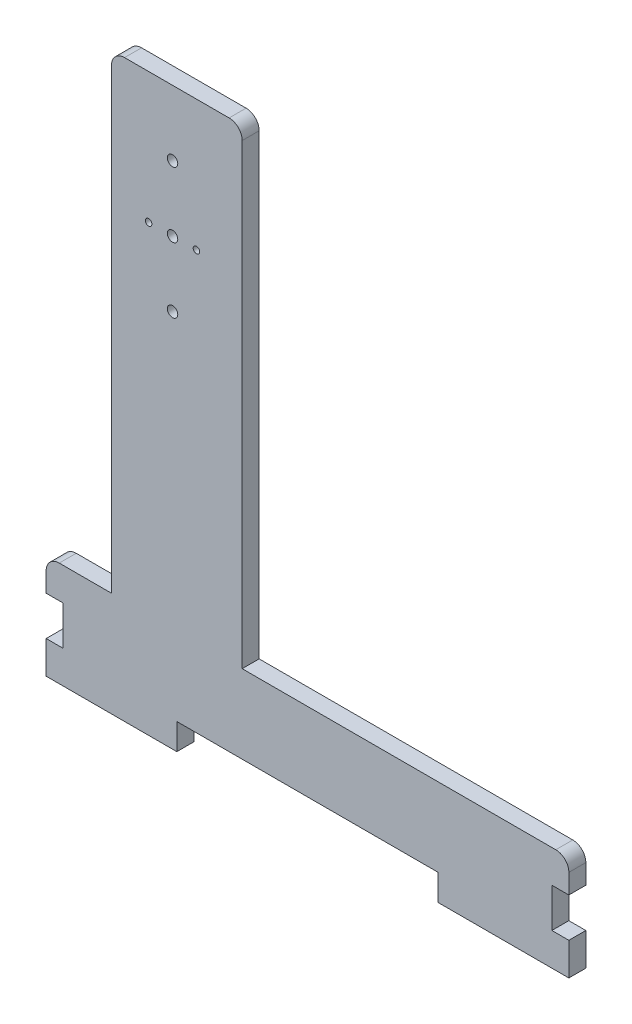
from build123d import *

# Parameters (mm, degrees)
SALIENTE_EXTRUIR1_DEPTH = 13
REDONDEO3_R             = 10
REDONDEO4_R             = 10
REDONDEO5_R             = 10
REDONDEO6_R             = 10
CROQUIS2_R              = 4
CROQUIS2_R_2            = 2.5
CROQUIS2_W              = 13
CROQUIS2_H              = 30
CORTAR_EXTRUIR1_DEPTH   = 13


with BuildPart() as part:
    # Croquis1 → Saliente-Extruir1 (new body)
    with BuildSketch(Plane.XY):
        Polygon((100, -40), (200, -40), (200, 40), (-50, 40), (-50, 400), (-150, 400), (-150, 40), (-200, 40), (-200, -40), (-100, -40), (-100, -20), (100, -20), align=None)
    extrude(amount=SALIENTE_EXTRUIR1_DEPTH)

    # Redondeo3
    redondeo3_edges = [part.edges().sort_by_distance(p)[0] for p in [
        (-150, 400, 6.5),
    ]]
    fillet(redondeo3_edges, radius=REDONDEO3_R)

    # Redondeo4
    redondeo4_edges = [part.edges().sort_by_distance(p)[0] for p in [
        (-50, 400, 6.5),
    ]]
    fillet(redondeo4_edges, radius=REDONDEO4_R)

    # Redondeo5
    redondeo5_edges = [part.edges().sort_by_distance(p)[0] for p in [
        (200, 40, 6.5),
    ]]
    fillet(redondeo5_edges, radius=REDONDEO5_R)

    # Redondeo6
    redondeo6_edges = [part.edges().sort_by_distance(p)[0] for p in [
        (-200, 40, 6.5),
    ]]
    fillet(redondeo6_edges, radius=REDONDEO6_R)

    # Croquis2 → Cortar-Extruir1 (cut)
    with BuildSketch(Plane.XY.offset(13)):
        with Locations((0, 350)):
            Circle(CROQUIS2_R)
        with Locations((0, 250)):
            Circle(CROQUIS2_R)
        with Locations((18.25, 300)):
            Circle(CROQUIS2_R_2)
        with Locations((-18.25, 300)):
            Circle(CROQUIS2_R_2)
        with Locations((0, 300)):
            Circle(CROQUIS2_R)
        with Locations((-103.286771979, 350)):
            Circle(CROQUIS2_R)
        with Locations((-103.286771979, 300)):
            Circle(CROQUIS2_R)
        with Locations((-103.286771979, 250)):
            Circle(CROQUIS2_R)
        with Locations((-84.986771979, 300)):
            Circle(CROQUIS2_R_2)
        with Locations((-121.586771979, 300)):
            Circle(CROQUIS2_R_2)
        with Locations((193.5, 0)):
            Rectangle(CROQUIS2_W, CROQUIS2_H)
        with Locations((-193.5, 0)):
            Rectangle(CROQUIS2_W, CROQUIS2_H)
    extrude(amount=-CORTAR_EXTRUIR1_DEPTH, mode=Mode.SUBTRACT)


solid = part.part
